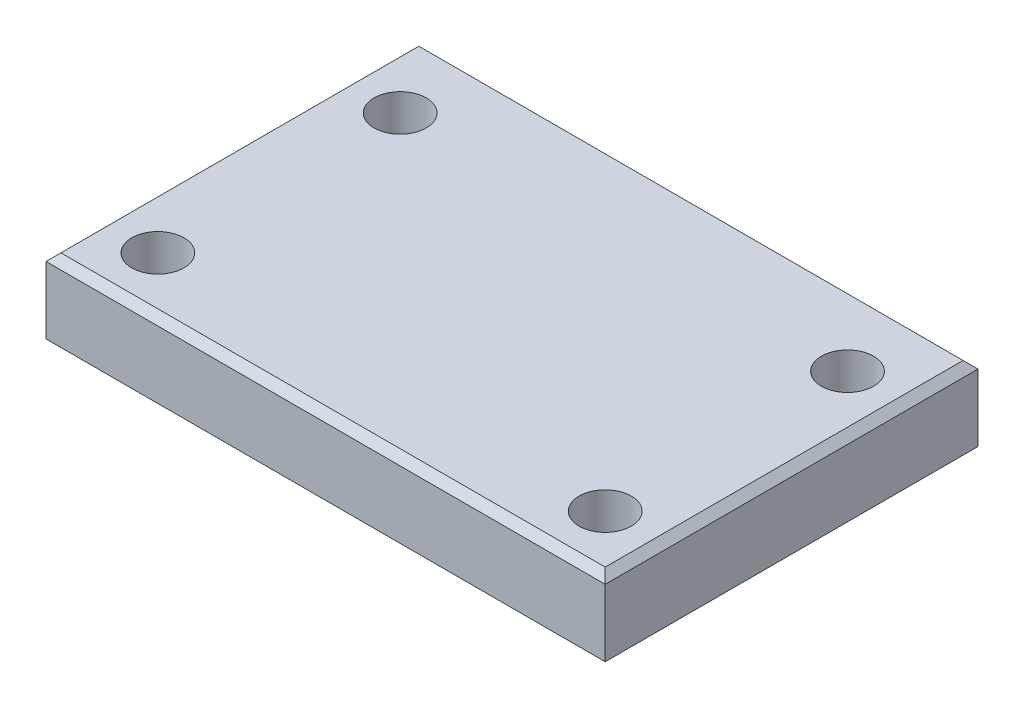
from build123d import *

# Parameters (mm, degrees)
SKETCH1_W              = 150
SKETCH1_H              = 100
EXTRUDE1_DEPTH         = 20
CHAMFER1_SIZE          = 2
M16X2_0_TAPPED_HOLE1_D = 14
LPATTERN3_COUNT        = 2
LPATTERN3_PITCH        = 65
LPATTERN3_COUNT_DIR2   = 2
LPATTERN3_PITCH_DIR2   = 120


with BuildPart() as part:
    # Sketch1 → Extrude1 (new body)
    with BuildSketch(Plane(origin=(0, 0, 0), x_dir=(1, 0, 0), z_dir=(0, 1, 0))):
        Rectangle(SKETCH1_W, SKETCH1_H)
    extrude(amount=EXTRUDE1_DEPTH)

    # Chamfer1
    chamfer1_edges = [part.edges().sort_by_distance(p)[0] for p in [
        (75, 20, 0),
        (0, 20, -50),
        (-75, 20, 0),
        (0, 20, 50),
    ]]
    chamfer(chamfer1_edges, length=CHAMFER1_SIZE)

    # M16x2.0 Tapped Hole1 (through all)
    with Locations(Plane(origin=(0, 20, 0), x_dir=(-1, 0, 0), z_dir=(0, 1, 0))):
        with Locations((60, 35)):
            m16x2_0_tapped_hole1 = Hole(M16X2_0_TAPPED_HOLE1_D / 2)

    # LPattern3: M16x2.0 Tapped Hole1 2 × 2
    with Locations(*[(j * LPATTERN3_PITCH_DIR2, 0, -i * LPATTERN3_PITCH) for i in range(LPATTERN3_COUNT) for j in range(LPATTERN3_COUNT_DIR2) if (i, j) != (0, 0)]):
        add(m16x2_0_tapped_hole1, mode=Mode.SUBTRACT)


solid = part.part
